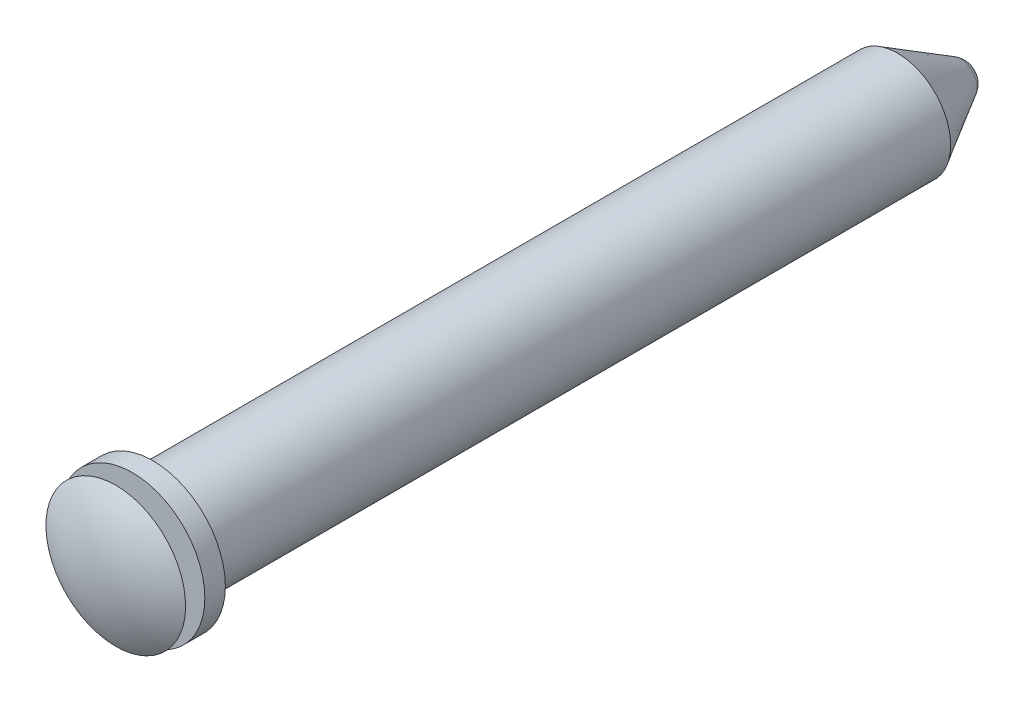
from build123d import *


with BuildPart() as part:
    # Sketch 1 → Revolve 1 (revolve)
    with BuildSketch(Plane(origin=(0, 0, 0), x_dir=(0, 0, -1), z_dir=(1, 0, 0)), mode=Mode.PRIVATE) as revolve_1_sk:
        with BuildLine():
            Line((0, 0), (33.5026, 0))
            ThreePointArc((33.5026, 0), (33.403270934, 0.37070112), (33.13189888, 0.642073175))
            Line((33.13189888, 0.642073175), (30.724475, 2.032))
            Line((30.724475, 2.032), (2.4892, 2.032))
            ThreePointArc((2.4892, 2.032), (2.273673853, 2.121273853), (2.1844, 2.3368))
            Line((2.1844, 2.3368), (2.1844, 2.778125))
            Line((2.1844, 2.778125), (1.397, 2.778125))
            Line((1.397, 2.778125), (1.397, 1.5875))
            Line((1.397, 1.5875), (0.762, 1.5875))
            Line((0.762, 1.5875), (0.762, 2.676056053))
            ThreePointArc((0.762, 2.676056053), (0.194212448, 1.391215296), (0, 0))
        make_face()
    revolve(revolve_1_sk.sketch.rotate(Axis((0, 0, 0), (0, 0, -1)), 90), axis=Axis((0, 0, 0), (0, 0, -1)))


solid = part.part
